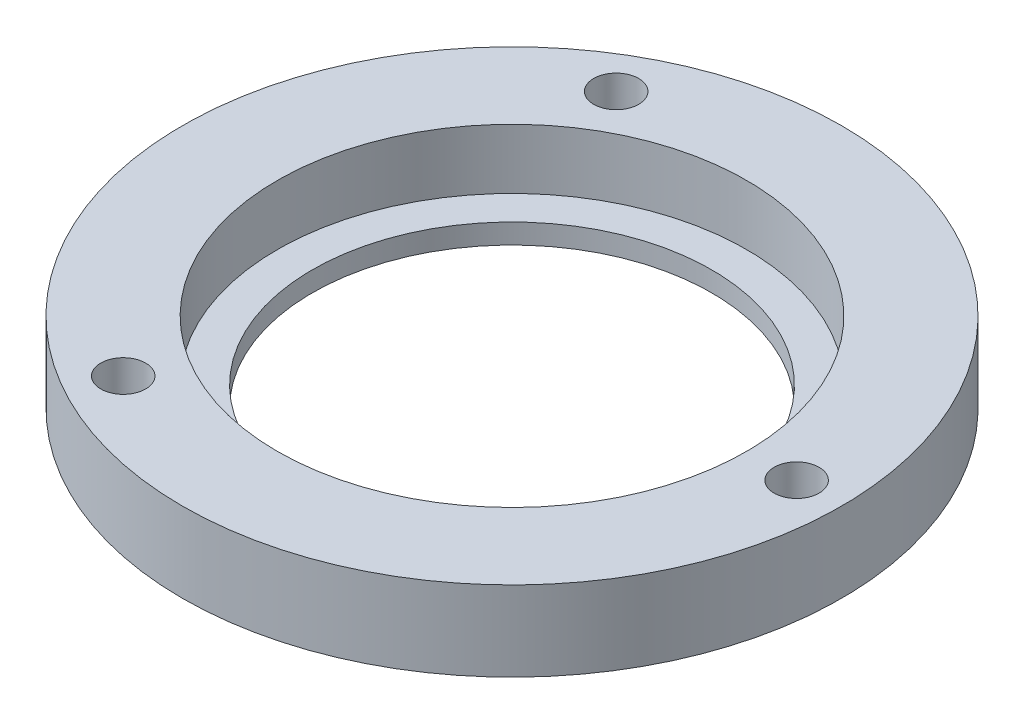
ISO-10303-21;
HEADER;
FILE_DESCRIPTION(('STEP AP214'),'2;1');
FILE_NAME('part.step','',(''),(''),'','','');
FILE_SCHEMA(('AUTOMOTIVE_DESIGN { 1 0 10303 214 1 1 1 1 }'));
ENDSEC;
DATA;
#1=APPLICATION_CONTEXT('core data for automotive mechanical design processes');
#2=APPLICATION_PROTOCOL_DEFINITION('international standard','automotive_design',2000,#1);
#3=PRODUCT_CONTEXT('',#1,'mechanical');
#4=PRODUCT('Part','Part','',(#3));
#5=PRODUCT_RELATED_PRODUCT_CATEGORY('part','',(#4));
#6=PRODUCT_DEFINITION_FORMATION('','',#4);
#7=PRODUCT_DEFINITION_CONTEXT('part definition',#1,'design');
#8=PRODUCT_DEFINITION('design','',#6,#7);
#9=PRODUCT_DEFINITION_SHAPE('','',#8);
#10=(LENGTH_UNIT() NAMED_UNIT(*) SI_UNIT(.MILLI.,.METRE.));
#11=(NAMED_UNIT(*) PLANE_ANGLE_UNIT() SI_UNIT($,.RADIAN.));
#12=(NAMED_UNIT(*) SI_UNIT($,.STERADIAN.) SOLID_ANGLE_UNIT());
#13=UNCERTAINTY_MEASURE_WITH_UNIT(LENGTH_MEASURE(1.E-05),#10,'distance_accuracy_value','');
#14=(GEOMETRIC_REPRESENTATION_CONTEXT(3) GLOBAL_UNCERTAINTY_ASSIGNED_CONTEXT((#13)) GLOBAL_UNIT_ASSIGNED_CONTEXT((#10,
#11,#12)) REPRESENTATION_CONTEXT('',''));
#15=CARTESIAN_POINT('',(0.,0.,0.));
#16=DIRECTION('',(0.,0.,1.));
#17=DIRECTION('',(1.,0.,0.));
#18=AXIS2_PLACEMENT_3D('',#15,#16,#17);
#19=CARTESIAN_POINT('',(23.5,2.,0.));
#20=DIRECTION('',(0.,-1.,0.));
#21=DIRECTION('',(0.,0.,-1.));
#22=AXIS2_PLACEMENT_3D('',#19,#20,#21);
#23=PLANE('',#22);
#24=CARTESIAN_POINT('',(0.,2.,0.));
#25=DIRECTION('',(0.,1.,0.));
#26=DIRECTION('',(0.,0.,1.));
#27=AXIS2_PLACEMENT_3D('',#24,#25,#26);
#28=CIRCLE('',#27,20.);
#29=CARTESIAN_POINT('',(0.,2.,20.));
#30=VERTEX_POINT('',#29);
#31=EDGE_CURVE('E53',#30,#30,#28,.T.);
#32=ORIENTED_EDGE('',*,*,#31,.F.);
#33=EDGE_LOOP('',(#32));
#34=FACE_BOUND('',#33,.T.);
#35=CARTESIAN_POINT('',(0.,2.,0.));
#36=DIRECTION('',(0.,1.,0.));
#37=DIRECTION('',(0.,0.,1.));
#38=AXIS2_PLACEMENT_3D('',#35,#36,#37);
#39=CIRCLE('',#38,23.5);
#40=CARTESIAN_POINT('',(0.,2.,23.5));
#41=VERTEX_POINT('',#40);
#42=EDGE_CURVE('E10',#41,#41,#39,.T.);
#43=ORIENTED_EDGE('',*,*,#42,.T.);
#44=EDGE_LOOP('',(#43));
#45=FACE_BOUND('',#44,.T.);
#46=ADVANCED_FACE('F31',(#34,#45),#23,.F.);
#47=CARTESIAN_POINT('',(0.,31.1775459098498,0.));
#48=DIRECTION('',(0.,1.,0.));
#49=DIRECTION('',(0.,0.,1.));
#50=AXIS2_PLACEMENT_3D('',#47,#48,#49);
#51=CYLINDRICAL_SURFACE('',#50,23.5);
#52=ORIENTED_EDGE('',*,*,#42,.F.);
#53=EDGE_LOOP('',(#52));
#54=FACE_BOUND('',#53,.T.);
#55=CARTESIAN_POINT('',(0.,8.00000000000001,0.));
#56=DIRECTION('',(0.,1.,0.));
#57=DIRECTION('',(0.,0.,1.));
#58=AXIS2_PLACEMENT_3D('',#55,#56,#57);
#59=CIRCLE('',#58,23.5);
#60=CARTESIAN_POINT('',(0.,8.00000000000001,23.5));
#61=VERTEX_POINT('',#60);
#62=EDGE_CURVE('E37',#61,#61,#59,.T.);
#63=ORIENTED_EDGE('',*,*,#62,.T.);
#64=EDGE_LOOP('',(#63));
#65=FACE_BOUND('',#64,.T.);
#66=ADVANCED_FACE('F136',(#54,#65),#51,.F.);
#67=CARTESIAN_POINT('',(33.,8.,0.));
#68=DIRECTION('',(0.,-1.,0.));
#69=DIRECTION('',(0.,0.,-1.));
#70=AXIS2_PLACEMENT_3D('',#67,#68,#69);
#71=PLANE('',#70);
#72=CARTESIAN_POINT('',(-14.2499999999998,8.00000000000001,-24.6817240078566));
#73=DIRECTION('',(0.,-1.,0.));
#74=DIRECTION('',(0.,0.,-1.));
#75=AXIS2_PLACEMENT_3D('',#72,#73,#74);
#76=CIRCLE('',#75,2.25);
#77=CARTESIAN_POINT('',(-14.2499999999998,8.00000000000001,-26.9317240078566));
#78=VERTEX_POINT('',#77);
#79=EDGE_CURVE('E89',#78,#78,#76,.T.);
#80=ORIENTED_EDGE('',*,*,#79,.T.);
#81=EDGE_LOOP('',(#80));
#82=FACE_BOUND('',#81,.T.);
#83=CARTESIAN_POINT('',(-14.2500000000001,8.00000000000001,24.6817240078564));
#84=DIRECTION('',(0.,-1.,0.));
#85=DIRECTION('',(0.,0.,-1.));
#86=AXIS2_PLACEMENT_3D('',#83,#84,#85);
#87=CIRCLE('',#86,2.25);
#88=CARTESIAN_POINT('',(-14.2500000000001,8.00000000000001,22.4317240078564));
#89=VERTEX_POINT('',#88);
#90=EDGE_CURVE('E77',#89,#89,#87,.T.);
#91=ORIENTED_EDGE('',*,*,#90,.T.);
#92=EDGE_LOOP('',(#91));
#93=FACE_BOUND('',#92,.T.);
#94=CARTESIAN_POINT('',(28.5,8.00000000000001,0.));
#95=DIRECTION('',(0.,-1.,0.));
#96=DIRECTION('',(0.,0.,-1.));
#97=AXIS2_PLACEMENT_3D('',#94,#95,#96);
#98=CIRCLE('',#97,2.25);
#99=CARTESIAN_POINT('',(28.5,8.00000000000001,-2.25));
#100=VERTEX_POINT('',#99);
#101=EDGE_CURVE('E65',#100,#100,#98,.T.);
#102=ORIENTED_EDGE('',*,*,#101,.T.);
#103=EDGE_LOOP('',(#102));
#104=FACE_BOUND('',#103,.T.);
#105=ORIENTED_EDGE('',*,*,#62,.F.);
#106=EDGE_LOOP('',(#105));
#107=FACE_BOUND('',#106,.T.);
#108=CARTESIAN_POINT('',(0.,8.,0.));
#109=DIRECTION('',(0.,1.,0.));
#110=DIRECTION('',(0.,0.,1.));
#111=AXIS2_PLACEMENT_3D('',#108,#109,#110);
#112=CIRCLE('',#111,33.);
#113=CARTESIAN_POINT('',(0.,8.,33.));
#114=VERTEX_POINT('',#113);
#115=EDGE_CURVE('E41',#114,#114,#112,.T.);
#116=ORIENTED_EDGE('',*,*,#115,.T.);
#117=EDGE_LOOP('',(#116));
#118=FACE_BOUND('',#117,.T.);
#119=ADVANCED_FACE('F93',(#82,#93,#104,#107,#118),#71,.F.);
#120=CARTESIAN_POINT('',(0.,31.1775459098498,0.));
#121=DIRECTION('',(0.,1.,0.));
#122=DIRECTION('',(0.,0.,1.));
#123=AXIS2_PLACEMENT_3D('',#120,#121,#122);
#124=CYLINDRICAL_SURFACE('',#123,33.);
#125=ORIENTED_EDGE('',*,*,#115,.F.);
#126=EDGE_LOOP('',(#125));
#127=FACE_BOUND('',#126,.T.);
#128=CARTESIAN_POINT('',(0.,0.,0.));
#129=DIRECTION('',(0.,1.,0.));
#130=DIRECTION('',(0.,0.,1.));
#131=AXIS2_PLACEMENT_3D('',#128,#129,#130);
#132=CIRCLE('',#131,33.);
#133=CARTESIAN_POINT('',(0.,0.,33.));
#134=VERTEX_POINT('',#133);
#135=EDGE_CURVE('E45',#134,#134,#132,.T.);
#136=ORIENTED_EDGE('',*,*,#135,.T.);
#137=EDGE_LOOP('',(#136));
#138=FACE_BOUND('',#137,.T.);
#139=ADVANCED_FACE('F119',(#127,#138),#124,.T.);
#140=CARTESIAN_POINT('',(20.,0.,0.));
#141=DIRECTION('',(0.,1.,0.));
#142=DIRECTION('',(0.,0.,1.));
#143=AXIS2_PLACEMENT_3D('',#140,#141,#142);
#144=PLANE('',#143);
#145=CARTESIAN_POINT('',(-14.2499999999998,0.,-24.6817240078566));
#146=DIRECTION('',(0.,-1.,0.));
#147=DIRECTION('',(0.,0.,-1.));
#148=AXIS2_PLACEMENT_3D('',#145,#146,#147);
#149=CIRCLE('',#148,4.);
#150=CARTESIAN_POINT('',(-14.2499999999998,0.,-28.6817240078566));
#151=VERTEX_POINT('',#150);
#152=EDGE_CURVE('E80',#151,#151,#149,.T.);
#153=ORIENTED_EDGE('',*,*,#152,.F.);
#154=EDGE_LOOP('',(#153));
#155=FACE_BOUND('',#154,.T.);
#156=CARTESIAN_POINT('',(-14.2500000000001,0.,24.6817240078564));
#157=DIRECTION('',(0.,-1.,0.));
#158=DIRECTION('',(0.,0.,-1.));
#159=AXIS2_PLACEMENT_3D('',#156,#157,#158);
#160=CIRCLE('',#159,4.);
#161=CARTESIAN_POINT('',(-14.2500000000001,0.,20.6817240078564));
#162=VERTEX_POINT('',#161);
#163=EDGE_CURVE('E68',#162,#162,#160,.T.);
#164=ORIENTED_EDGE('',*,*,#163,.F.);
#165=EDGE_LOOP('',(#164));
#166=FACE_BOUND('',#165,.T.);
#167=CARTESIAN_POINT('',(28.5,0.,0.));
#168=DIRECTION('',(0.,-1.,0.));
#169=DIRECTION('',(0.,0.,-1.));
#170=AXIS2_PLACEMENT_3D('',#167,#168,#169);
#171=CIRCLE('',#170,4.);
#172=CARTESIAN_POINT('',(28.5,0.,-4.));
#173=VERTEX_POINT('',#172);
#174=EDGE_CURVE('E56',#173,#173,#171,.T.);
#175=ORIENTED_EDGE('',*,*,#174,.F.);
#176=EDGE_LOOP('',(#175));
#177=FACE_BOUND('',#176,.T.);
#178=ORIENTED_EDGE('',*,*,#135,.F.);
#179=EDGE_LOOP('',(#178));
#180=FACE_BOUND('',#179,.T.);
#181=CARTESIAN_POINT('',(0.,0.,0.));
#182=DIRECTION('',(0.,1.,0.));
#183=DIRECTION('',(0.,0.,1.));
#184=AXIS2_PLACEMENT_3D('',#181,#182,#183);
#185=CIRCLE('',#184,20.);
#186=CARTESIAN_POINT('',(0.,0.,20.));
#187=VERTEX_POINT('',#186);
#188=EDGE_CURVE('E50',#187,#187,#185,.T.);
#189=ORIENTED_EDGE('',*,*,#188,.T.);
#190=EDGE_LOOP('',(#189));
#191=FACE_BOUND('',#190,.T.);
#192=ADVANCED_FACE('F115',(#155,#166,#177,#180,#191),#144,.F.);
#193=CARTESIAN_POINT('',(0.,31.1775459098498,0.));
#194=DIRECTION('',(0.,1.,0.));
#195=DIRECTION('',(0.,0.,1.));
#196=AXIS2_PLACEMENT_3D('',#193,#194,#195);
#197=CYLINDRICAL_SURFACE('',#196,20.);
#198=ORIENTED_EDGE('',*,*,#188,.F.);
#199=EDGE_LOOP('',(#198));
#200=FACE_BOUND('',#199,.T.);
#201=ORIENTED_EDGE('',*,*,#31,.T.);
#202=EDGE_LOOP('',(#201));
#203=FACE_BOUND('',#202,.T.);
#204=ADVANCED_FACE('F118',(#200,#203),#197,.F.);
#205=CARTESIAN_POINT('',(28.5,0.,0.));
#206=DIRECTION('',(0.,-1.,0.));
#207=DIRECTION('',(0.,0.,-1.));
#208=AXIS2_PLACEMENT_3D('',#205,#206,#207);
#209=CYLINDRICAL_SURFACE('',#208,4.);
#210=CARTESIAN_POINT('',(28.5,4.,0.));
#211=DIRECTION('',(0.,-1.,0.));
#212=DIRECTION('',(0.,0.,-1.));
#213=AXIS2_PLACEMENT_3D('',#210,#211,#212);
#214=CIRCLE('',#213,4.);
#215=CARTESIAN_POINT('',(28.5,4.,-4.));
#216=VERTEX_POINT('',#215);
#217=EDGE_CURVE('E59',#216,#216,#214,.T.);
#218=ORIENTED_EDGE('',*,*,#217,.F.);
#219=EDGE_LOOP('',(#218));
#220=FACE_BOUND('',#219,.T.);
#221=ORIENTED_EDGE('',*,*,#174,.T.);
#222=EDGE_LOOP('',(#221));
#223=FACE_BOUND('',#222,.T.);
#224=ADVANCED_FACE('F131',(#220,#223),#209,.F.);
#225=CARTESIAN_POINT('',(30.75,4.,0.));
#226=DIRECTION('',(0.,1.,0.));
#227=DIRECTION('',(0.,0.,1.));
#228=AXIS2_PLACEMENT_3D('',#225,#226,#227);
#229=PLANE('',#228);
#230=CARTESIAN_POINT('',(28.5,4.,0.));
#231=DIRECTION('',(0.,-1.,0.));
#232=DIRECTION('',(0.,0.,-1.));
#233=AXIS2_PLACEMENT_3D('',#230,#231,#232);
#234=CIRCLE('',#233,2.25);
#235=CARTESIAN_POINT('',(28.5,4.,-2.25));
#236=VERTEX_POINT('',#235);
#237=EDGE_CURVE('E62',#236,#236,#234,.T.);
#238=ORIENTED_EDGE('',*,*,#237,.F.);
#239=EDGE_LOOP('',(#238));
#240=FACE_BOUND('',#239,.T.);
#241=ORIENTED_EDGE('',*,*,#217,.T.);
#242=EDGE_LOOP('',(#241));
#243=FACE_BOUND('',#242,.T.);
#244=ADVANCED_FACE('F151',(#240,#243),#229,.F.);
#245=CARTESIAN_POINT('',(28.5,0.,0.));
#246=DIRECTION('',(0.,-1.,0.));
#247=DIRECTION('',(0.,0.,-1.));
#248=AXIS2_PLACEMENT_3D('',#245,#246,#247);
#249=CYLINDRICAL_SURFACE('',#248,2.25);
#250=ORIENTED_EDGE('',*,*,#101,.F.);
#251=EDGE_LOOP('',(#250));
#252=FACE_BOUND('',#251,.T.);
#253=ORIENTED_EDGE('',*,*,#237,.T.);
#254=EDGE_LOOP('',(#253));
#255=FACE_BOUND('',#254,.T.);
#256=ADVANCED_FACE('F155',(#252,#255),#249,.F.);
#257=CARTESIAN_POINT('',(-14.2500000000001,0.,24.6817240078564));
#258=DIRECTION('',(0.,-1.,0.));
#259=DIRECTION('',(0.,0.,-1.));
#260=AXIS2_PLACEMENT_3D('',#257,#258,#259);
#261=CYLINDRICAL_SURFACE('',#260,4.);
#262=CARTESIAN_POINT('',(-14.2500000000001,4.,24.6817240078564));
#263=DIRECTION('',(0.,-1.,0.));
#264=DIRECTION('',(0.,0.,-1.));
#265=AXIS2_PLACEMENT_3D('',#262,#263,#264);
#266=CIRCLE('',#265,4.);
#267=CARTESIAN_POINT('',(-14.2500000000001,4.,20.6817240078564));
#268=VERTEX_POINT('',#267);
#269=EDGE_CURVE('E71',#268,#268,#266,.T.);
#270=ORIENTED_EDGE('',*,*,#269,.F.);
#271=EDGE_LOOP('',(#270));
#272=FACE_BOUND('',#271,.T.);
#273=ORIENTED_EDGE('',*,*,#163,.T.);
#274=EDGE_LOOP('',(#273));
#275=FACE_BOUND('',#274,.T.);
#276=ADVANCED_FACE('F159',(#272,#275),#261,.F.);
#277=CARTESIAN_POINT('',(-12.0000000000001,4.,24.6817240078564));
#278=DIRECTION('',(0.,1.,0.));
#279=DIRECTION('',(0.,0.,1.));
#280=AXIS2_PLACEMENT_3D('',#277,#278,#279);
#281=PLANE('',#280);
#282=CARTESIAN_POINT('',(-14.2500000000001,4.,24.6817240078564));
#283=DIRECTION('',(0.,-1.,0.));
#284=DIRECTION('',(0.,0.,-1.));
#285=AXIS2_PLACEMENT_3D('',#282,#283,#284);
#286=CIRCLE('',#285,2.25);
#287=CARTESIAN_POINT('',(-14.2500000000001,4.,22.4317240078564));
#288=VERTEX_POINT('',#287);
#289=EDGE_CURVE('E74',#288,#288,#286,.T.);
#290=ORIENTED_EDGE('',*,*,#289,.F.);
#291=EDGE_LOOP('',(#290));
#292=FACE_BOUND('',#291,.T.);
#293=ORIENTED_EDGE('',*,*,#269,.T.);
#294=EDGE_LOOP('',(#293));
#295=FACE_BOUND('',#294,.T.);
#296=ADVANCED_FACE('F163',(#292,#295),#281,.F.);
#297=CARTESIAN_POINT('',(-14.2500000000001,0.,24.6817240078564));
#298=DIRECTION('',(0.,-1.,0.));
#299=DIRECTION('',(0.,0.,-1.));
#300=AXIS2_PLACEMENT_3D('',#297,#298,#299);
#301=CYLINDRICAL_SURFACE('',#300,2.25);
#302=ORIENTED_EDGE('',*,*,#90,.F.);
#303=EDGE_LOOP('',(#302));
#304=FACE_BOUND('',#303,.T.);
#305=ORIENTED_EDGE('',*,*,#289,.T.);
#306=EDGE_LOOP('',(#305));
#307=FACE_BOUND('',#306,.T.);
#308=ADVANCED_FACE('F111',(#304,#307),#301,.F.);
#309=CARTESIAN_POINT('',(-14.2499999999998,0.,-24.6817240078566));
#310=DIRECTION('',(0.,-1.,0.));
#311=DIRECTION('',(0.,0.,-1.));
#312=AXIS2_PLACEMENT_3D('',#309,#310,#311);
#313=CYLINDRICAL_SURFACE('',#312,4.);
#314=CARTESIAN_POINT('',(-14.2499999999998,4.,-24.6817240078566));
#315=DIRECTION('',(0.,-1.,0.));
#316=DIRECTION('',(0.,0.,-1.));
#317=AXIS2_PLACEMENT_3D('',#314,#315,#316);
#318=CIRCLE('',#317,4.);
#319=CARTESIAN_POINT('',(-14.2499999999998,4.,-28.6817240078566));
#320=VERTEX_POINT('',#319);
#321=EDGE_CURVE('E83',#320,#320,#318,.T.);
#322=ORIENTED_EDGE('',*,*,#321,.F.);
#323=EDGE_LOOP('',(#322));
#324=FACE_BOUND('',#323,.T.);
#325=ORIENTED_EDGE('',*,*,#152,.T.);
#326=EDGE_LOOP('',(#325));
#327=FACE_BOUND('',#326,.T.);
#328=ADVANCED_FACE('F105',(#324,#327),#313,.F.);
#329=CARTESIAN_POINT('',(-11.9999999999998,4.,-24.6817240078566));
#330=DIRECTION('',(0.,1.,0.));
#331=DIRECTION('',(0.,0.,1.));
#332=AXIS2_PLACEMENT_3D('',#329,#330,#331);
#333=PLANE('',#332);
#334=CARTESIAN_POINT('',(-14.2499999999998,4.,-24.6817240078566));
#335=DIRECTION('',(0.,-1.,0.));
#336=DIRECTION('',(0.,0.,-1.));
#337=AXIS2_PLACEMENT_3D('',#334,#335,#336);
#338=CIRCLE('',#337,2.25);
#339=CARTESIAN_POINT('',(-14.2499999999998,4.,-26.9317240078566));
#340=VERTEX_POINT('',#339);
#341=EDGE_CURVE('E86',#340,#340,#338,.T.);
#342=ORIENTED_EDGE('',*,*,#341,.F.);
#343=EDGE_LOOP('',(#342));
#344=FACE_BOUND('',#343,.T.);
#345=ORIENTED_EDGE('',*,*,#321,.T.);
#346=EDGE_LOOP('',(#345));
#347=FACE_BOUND('',#346,.T.);
#348=ADVANCED_FACE('F99',(#344,#347),#333,.F.);
#349=CARTESIAN_POINT('',(-14.2499999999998,0.,-24.6817240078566));
#350=DIRECTION('',(0.,-1.,0.));
#351=DIRECTION('',(0.,0.,-1.));
#352=AXIS2_PLACEMENT_3D('',#349,#350,#351);
#353=CYLINDRICAL_SURFACE('',#352,2.25);
#354=ORIENTED_EDGE('',*,*,#79,.F.);
#355=EDGE_LOOP('',(#354));
#356=FACE_BOUND('',#355,.T.);
#357=ORIENTED_EDGE('',*,*,#341,.T.);
#358=EDGE_LOOP('',(#357));
#359=FACE_BOUND('',#358,.T.);
#360=ADVANCED_FACE('F96',(#356,#359),#353,.F.);
#361=CLOSED_SHELL('',(#46,#66,#119,#139,#192,#204,#224,#244,#256,#276,#296,#308,#328,#348,#360));
#362=MANIFOLD_SOLID_BREP('B2',#361);
#363=ADVANCED_BREP_SHAPE_REPRESENTATION('',(#18,#362),#14);
#364=SHAPE_DEFINITION_REPRESENTATION(#9,#363);
ENDSEC;
END-ISO-10303-21;
